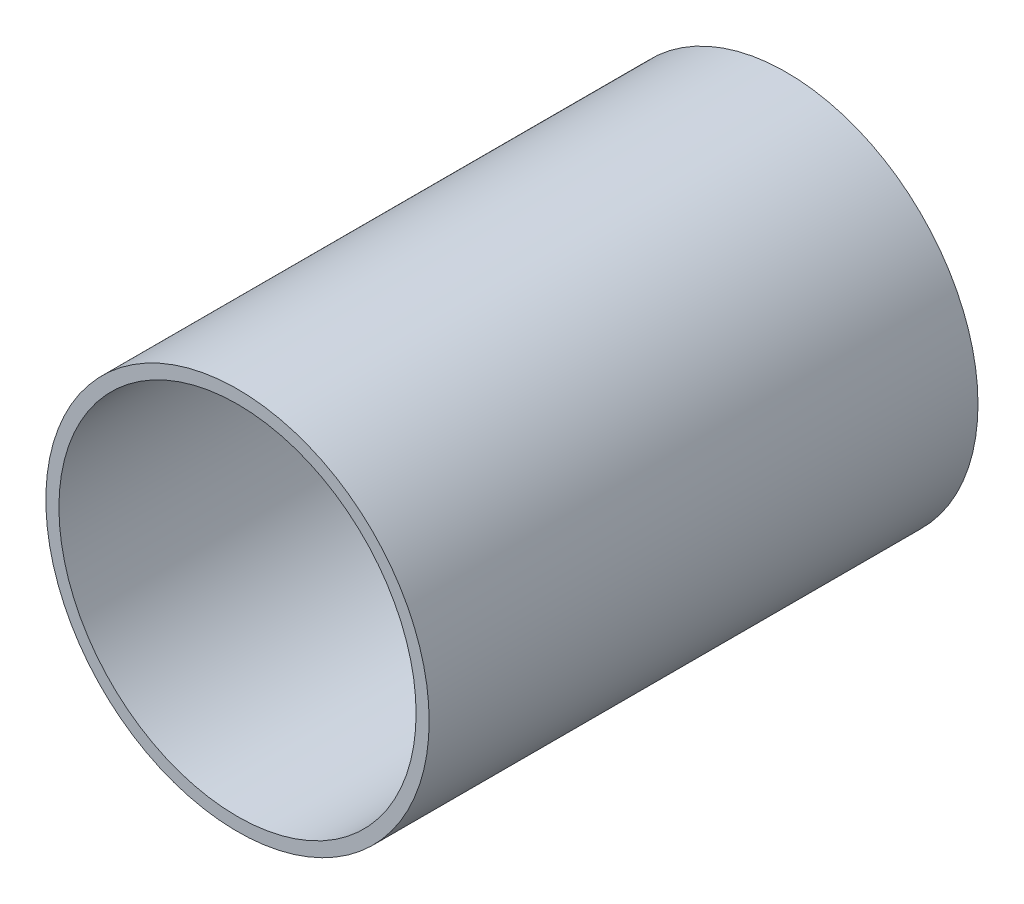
from build123d import *

# Parameters (mm, degrees)
ESQUISSE1_R      = 22
ESQUISSE1_R_2    = 20.5
EXTRUSION1_DEPTH = 63


with BuildPart() as part:
    # Esquisse1 → Extrusion1 (new body)
    with BuildSketch(Plane.XY):
        Circle(ESQUISSE1_R)
        Circle(ESQUISSE1_R_2, mode=Mode.SUBTRACT)
    extrude(amount=EXTRUSION1_DEPTH)


solid = part.part
